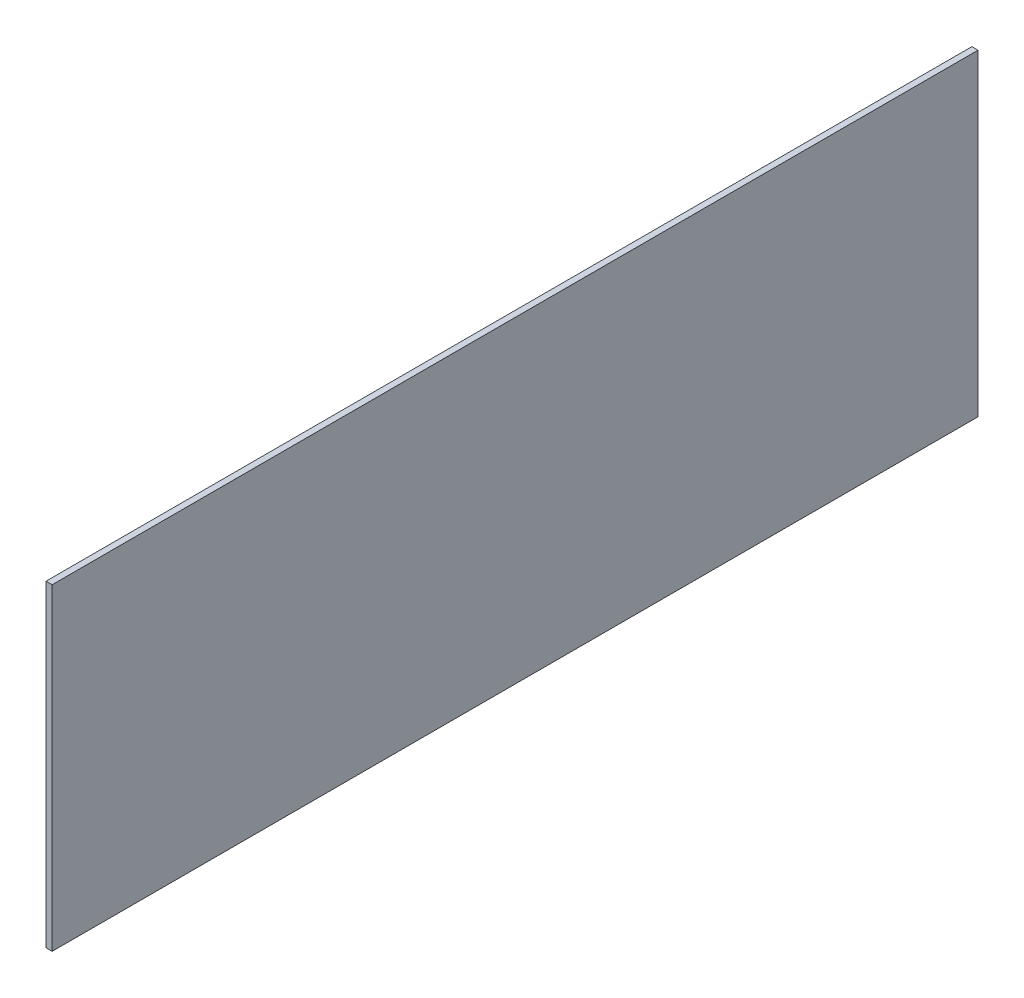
ISO-10303-21;
HEADER;
FILE_DESCRIPTION(('STEP AP214'),'2;1');
FILE_NAME('part.step','',(''),(''),'','','');
FILE_SCHEMA(('AUTOMOTIVE_DESIGN { 1 0 10303 214 1 1 1 1 }'));
ENDSEC;
DATA;
#1=APPLICATION_CONTEXT('core data for automotive mechanical design processes');
#2=APPLICATION_PROTOCOL_DEFINITION('international standard','automotive_design',2000,#1);
#3=PRODUCT_CONTEXT('',#1,'mechanical');
#4=PRODUCT('Part','Part','',(#3));
#5=PRODUCT_RELATED_PRODUCT_CATEGORY('part','',(#4));
#6=PRODUCT_DEFINITION_FORMATION('','',#4);
#7=PRODUCT_DEFINITION_CONTEXT('part definition',#1,'design');
#8=PRODUCT_DEFINITION('design','',#6,#7);
#9=PRODUCT_DEFINITION_SHAPE('','',#8);
#10=(LENGTH_UNIT() NAMED_UNIT(*) SI_UNIT(.MILLI.,.METRE.));
#11=(NAMED_UNIT(*) PLANE_ANGLE_UNIT() SI_UNIT($,.RADIAN.));
#12=(NAMED_UNIT(*) SI_UNIT($,.STERADIAN.) SOLID_ANGLE_UNIT());
#13=UNCERTAINTY_MEASURE_WITH_UNIT(LENGTH_MEASURE(1.E-05),#10,'distance_accuracy_value','');
#14=(GEOMETRIC_REPRESENTATION_CONTEXT(3) GLOBAL_UNCERTAINTY_ASSIGNED_CONTEXT((#13)) GLOBAL_UNIT_ASSIGNED_CONTEXT((#10,
#11,#12)) REPRESENTATION_CONTEXT('',''));
#15=CARTESIAN_POINT('',(0.,0.,0.));
#16=DIRECTION('',(0.,0.,1.));
#17=DIRECTION('',(1.,0.,0.));
#18=AXIS2_PLACEMENT_3D('',#15,#16,#17);
#19=CARTESIAN_POINT('',(3.,0.,0.));
#20=DIRECTION('',(0.,0.,-1.));
#21=DIRECTION('',(-1.,0.,0.));
#22=AXIS2_PLACEMENT_3D('',#19,#20,#21);
#23=PLANE('',#22);
#24=DIRECTION('',(0.,-1.,0.));
#25=VECTOR('',#24,1.);
#26=CARTESIAN_POINT('',(0.,0.,0.));
#27=LINE('',#26,#25);
#28=CARTESIAN_POINT('',(0.,155.,0.));
#29=VERTEX_POINT('',#28);
#30=CARTESIAN_POINT('',(0.,0.,0.));
#31=VERTEX_POINT('',#30);
#32=EDGE_CURVE('E134',#29,#31,#27,.T.);
#33=ORIENTED_EDGE('',*,*,#32,.T.);
#34=DIRECTION('',(-1.,0.,0.));
#35=VECTOR('',#34,1.);
#36=CARTESIAN_POINT('',(3.,0.,0.));
#37=LINE('',#36,#35);
#38=CARTESIAN_POINT('',(3.,0.,0.));
#39=VERTEX_POINT('',#38);
#40=EDGE_CURVE('E12',#39,#31,#37,.T.);
#41=ORIENTED_EDGE('',*,*,#40,.F.);
#42=DIRECTION('',(0.,-1.,0.));
#43=VECTOR('',#42,1.);
#44=CARTESIAN_POINT('',(3.,0.,0.));
#45=LINE('',#44,#43);
#46=CARTESIAN_POINT('',(3.,155.,0.));
#47=VERTEX_POINT('',#46);
#48=EDGE_CURVE('E98',#47,#39,#45,.T.);
#49=ORIENTED_EDGE('',*,*,#48,.F.);
#50=DIRECTION('',(-1.,0.,0.));
#51=VECTOR('',#50,1.);
#52=CARTESIAN_POINT('',(3.,155.,0.));
#53=LINE('',#52,#51);
#54=EDGE_CURVE('E110',#47,#29,#53,.T.);
#55=ORIENTED_EDGE('',*,*,#54,.T.);
#56=EDGE_LOOP('',(#33,#41,#49,#55));
#57=FACE_BOUND('',#56,.T.);
#58=ADVANCED_FACE('F46',(#57),#23,.F.);
#59=CARTESIAN_POINT('',(3.,0.,0.));
#60=DIRECTION('',(0.,1.,0.));
#61=DIRECTION('',(0.,0.,1.));
#62=AXIS2_PLACEMENT_3D('',#59,#60,#61);
#63=PLANE('',#62);
#64=DIRECTION('',(0.,0.,-1.));
#65=VECTOR('',#64,1.);
#66=CARTESIAN_POINT('',(0.,0.,0.));
#67=LINE('',#66,#65);
#68=CARTESIAN_POINT('',(0.,0.,-452.));
#69=VERTEX_POINT('',#68);
#70=EDGE_CURVE('E103',#31,#69,#67,.T.);
#71=ORIENTED_EDGE('',*,*,#70,.T.);
#72=DIRECTION('',(-1.,0.,0.));
#73=VECTOR('',#72,1.);
#74=CARTESIAN_POINT('',(3.,0.,-452.));
#75=LINE('',#74,#73);
#76=CARTESIAN_POINT('',(3.,0.,-452.));
#77=VERTEX_POINT('',#76);
#78=EDGE_CURVE('E55',#77,#69,#75,.T.);
#79=ORIENTED_EDGE('',*,*,#78,.F.);
#80=DIRECTION('',(0.,0.,-1.));
#81=VECTOR('',#80,1.);
#82=CARTESIAN_POINT('',(3.,0.,0.));
#83=LINE('',#82,#81);
#84=EDGE_CURVE('E93',#39,#77,#83,.T.);
#85=ORIENTED_EDGE('',*,*,#84,.F.);
#86=ORIENTED_EDGE('',*,*,#40,.T.);
#87=EDGE_LOOP('',(#71,#79,#85,#86));
#88=FACE_BOUND('',#87,.T.);
#89=ADVANCED_FACE('F102',(#88),#63,.F.);
#90=CARTESIAN_POINT('',(3.,0.,-452.));
#91=DIRECTION('',(0.,0.,1.));
#92=DIRECTION('',(1.,0.,0.));
#93=AXIS2_PLACEMENT_3D('',#90,#91,#92);
#94=PLANE('',#93);
#95=DIRECTION('',(0.,1.,0.));
#96=VECTOR('',#95,1.);
#97=CARTESIAN_POINT('',(0.,0.,-452.));
#98=LINE('',#97,#96);
#99=CARTESIAN_POINT('',(0.,155.,-452.));
#100=VERTEX_POINT('',#99);
#101=EDGE_CURVE('E80',#69,#100,#98,.T.);
#102=ORIENTED_EDGE('',*,*,#101,.T.);
#103=DIRECTION('',(-1.,0.,0.));
#104=VECTOR('',#103,1.);
#105=CARTESIAN_POINT('',(3.,155.,-452.));
#106=LINE('',#105,#104);
#107=CARTESIAN_POINT('',(3.,155.,-452.));
#108=VERTEX_POINT('',#107);
#109=EDGE_CURVE('E105',#108,#100,#106,.T.);
#110=ORIENTED_EDGE('',*,*,#109,.F.);
#111=DIRECTION('',(0.,1.,0.));
#112=VECTOR('',#111,1.);
#113=CARTESIAN_POINT('',(3.,0.,-452.));
#114=LINE('',#113,#112);
#115=EDGE_CURVE('E96',#77,#108,#114,.T.);
#116=ORIENTED_EDGE('',*,*,#115,.F.);
#117=ORIENTED_EDGE('',*,*,#78,.T.);
#118=EDGE_LOOP('',(#102,#110,#116,#117));
#119=FACE_BOUND('',#118,.T.);
#120=ADVANCED_FACE('F106',(#119),#94,.F.);
#121=CARTESIAN_POINT('',(3.,155.,0.));
#122=DIRECTION('',(0.,-1.,0.));
#123=DIRECTION('',(0.,0.,-1.));
#124=AXIS2_PLACEMENT_3D('',#121,#122,#123);
#125=PLANE('',#124);
#126=DIRECTION('',(0.,0.,1.));
#127=VECTOR('',#126,1.);
#128=CARTESIAN_POINT('',(0.,155.,0.));
#129=LINE('',#128,#127);
#130=EDGE_CURVE('E86',#100,#29,#129,.T.);
#131=ORIENTED_EDGE('',*,*,#130,.T.);
#132=ORIENTED_EDGE('',*,*,#54,.F.);
#133=DIRECTION('',(0.,0.,1.));
#134=VECTOR('',#133,1.);
#135=CARTESIAN_POINT('',(3.,155.,0.));
#136=LINE('',#135,#134);
#137=EDGE_CURVE('E63',#108,#47,#136,.T.);
#138=ORIENTED_EDGE('',*,*,#137,.F.);
#139=ORIENTED_EDGE('',*,*,#109,.T.);
#140=EDGE_LOOP('',(#131,#132,#138,#139));
#141=FACE_BOUND('',#140,.T.);
#142=ADVANCED_FACE('F129',(#141),#125,.F.);
#143=CARTESIAN_POINT('',(3.,0.,0.));
#144=DIRECTION('',(-1.,0.,0.));
#145=DIRECTION('',(0.,0.,1.));
#146=AXIS2_PLACEMENT_3D('',#143,#144,#145);
#147=PLANE('',#146);
#148=ORIENTED_EDGE('',*,*,#48,.T.);
#149=ORIENTED_EDGE('',*,*,#84,.T.);
#150=ORIENTED_EDGE('',*,*,#115,.T.);
#151=ORIENTED_EDGE('',*,*,#137,.T.);
#152=EDGE_LOOP('',(#148,#149,#150,#151));
#153=FACE_BOUND('',#152,.T.);
#154=ADVANCED_FACE('F94',(#153),#147,.F.);
#155=CARTESIAN_POINT('',(0.,0.,0.));
#156=DIRECTION('',(-1.,0.,0.));
#157=DIRECTION('',(0.,0.,1.));
#158=AXIS2_PLACEMENT_3D('',#155,#156,#157);
#159=PLANE('',#158);
#160=ORIENTED_EDGE('',*,*,#32,.F.);
#161=ORIENTED_EDGE('',*,*,#130,.F.);
#162=ORIENTED_EDGE('',*,*,#101,.F.);
#163=ORIENTED_EDGE('',*,*,#70,.F.);
#164=EDGE_LOOP('',(#160,#161,#162,#163));
#165=FACE_BOUND('',#164,.T.);
#166=ADVANCED_FACE('F132',(#165),#159,.T.);
#167=CLOSED_SHELL('',(#58,#89,#120,#142,#154,#166));
#168=MANIFOLD_SOLID_BREP('B2',#167);
#169=ADVANCED_BREP_SHAPE_REPRESENTATION('',(#18,#168),#14);
#170=SHAPE_DEFINITION_REPRESENTATION(#9,#169);
ENDSEC;
END-ISO-10303-21;
